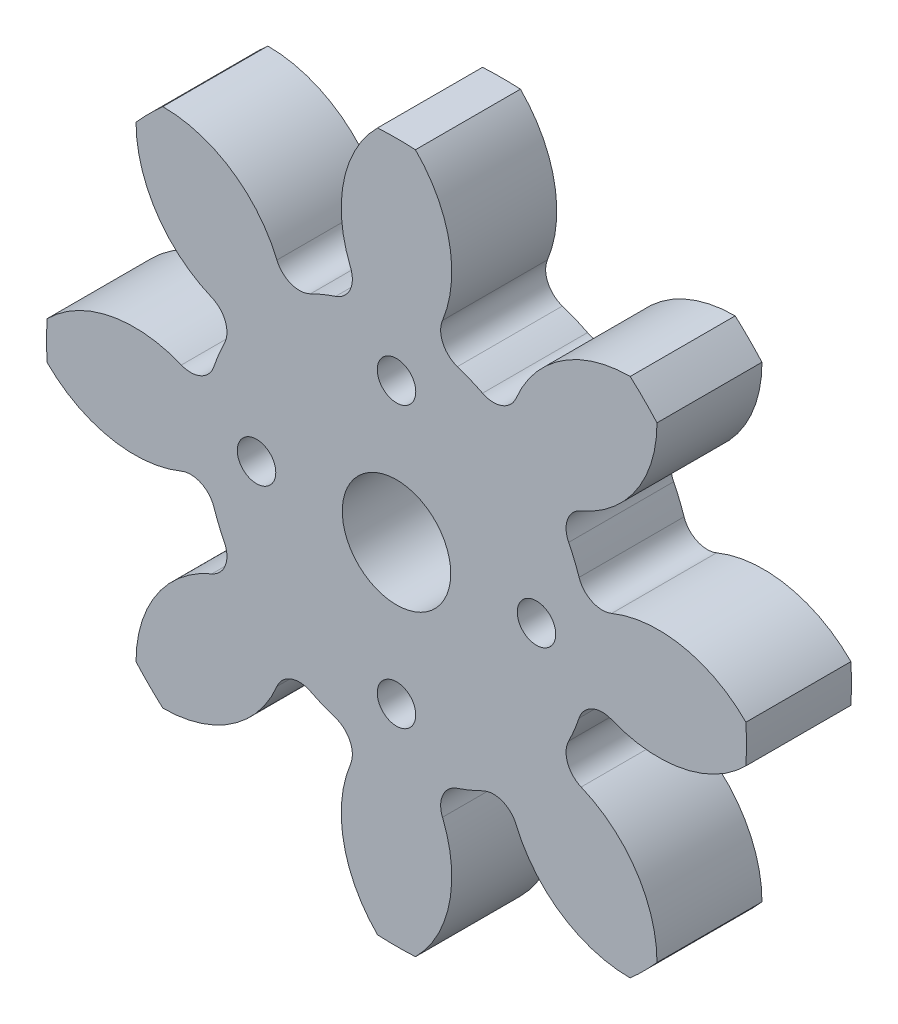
from build123d import *

# Parameters (mm, degrees)
BOSS_EXTRU_1_DEPTH                 = 6
CONG_1_R                           = 1.4
R_P_TITION_CIRCULAIRE4_COUNT       = 8
CONG_1_OF_R_P_TITION_CIRCULAIRE4_R = 1.4
ESQUISSE6_R                        = 3.1
ENL_V_MAT_EXTRU_1_DEPTH            = 29.913664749
ESQUISSE7_R                        = 1.1
ENL_V_MAT_EXTRU_2_DEPTH            = 2


with BuildPart() as part:
    # Esquisse3 → Boss.-Extru.1 (new body)
    with BuildSketch(Plane.XY):
        with BuildLine():
            Line((-4.209517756, 10.162674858), (0, 0))
            Line((0, 0), (4.209517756, 10.162674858))
            ThreePointArc((4.209517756, 10.162674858), (3.035498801, 10.572877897), (1.822680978, 10.847941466))
            ThreePointArc((1.822680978, 10.847941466), (3.134893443, 15.545936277), (1.081987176, 19.970711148))
            ThreePointArc((1.081987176, 19.970711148), (0, 20), (-1.081987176, 19.970711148))
            ThreePointArc((-1.081987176, 19.970711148), (-3.134893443, 15.545936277), (-1.822680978, 10.847941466))
            ThreePointArc((-1.822680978, 10.847941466), (-3.035498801, 10.572877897), (-4.209517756, 10.162674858))
        make_face()
    boss_extru_1 = extrude(amount=BOSS_EXTRU_1_DEPTH)

    # Cong_1
    cong_1_edges = [part.edges().sort_by_distance(p)[0] for p in [
        (-1.822680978, 10.847941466, 3),
        (1.822680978, 10.847941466, 3),
    ]]
    fillet(cong_1_edges, radius=CONG_1_R)

    # R_p_tition circulaire4: Boss.-Extru.1 ×8 about axis
    r_p_tition_circulaire4_axis = Axis((0, 0, 0), (0, 0, 1))
    for i in range(1, R_P_TITION_CIRCULAIRE4_COUNT):
        add(boss_extru_1.rotate(r_p_tition_circulaire4_axis, i * 360 / R_P_TITION_CIRCULAIRE4_COUNT))

    # Cong_1 of R_p_tition circulaire4
    cong_1_of_r_p_tition_circulaire4_edges = [part.edges().sort_by_distance(p)[0] for p in [
        (-8.959483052, 6.381822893, 3),
        (-6.381822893, 8.959483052, 3),
        (-10.847941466, -1.822680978, 3),
        (-10.847941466, 1.822680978, 3),
        (-6.381822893, -8.959483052, 3),
        (-8.959483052, -6.381822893, 3),
        (1.822680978, -10.847941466, 3),
        (-1.822680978, -10.847941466, 3),
        (8.959483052, -6.381822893, 3),
        (6.381822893, -8.959483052, 3),
        (10.847941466, 1.822680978, 3),
        (10.847941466, -1.822680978, 3),
        (6.381822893, 8.959483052, 3),
        (8.959483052, 6.381822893, 3),
    ]]
    fillet(cong_1_of_r_p_tition_circulaire4_edges, radius=CONG_1_OF_R_P_TITION_CIRCULAIRE4_R)

    # Esquisse6 → Enl_v. mat.-Extru.1 (cut, through all)
    with BuildSketch(Plane.XY.offset(6)):
        Circle(ESQUISSE6_R)
    extrude(amount=-ENL_V_MAT_EXTRU_1_DEPTH, mode=Mode.SUBTRACT)

    # Esquisse7 → Enl_v. mat.-Extru.2 (cut)
    with BuildSketch(Plane.XY.offset(6)):
        with Locations((0, 8)):
            Circle(ESQUISSE7_R)
        with Locations((-8, 0)):
            Circle(ESQUISSE7_R)
        with Locations((0, -8)):
            Circle(ESQUISSE7_R)
        with Locations((8, 0)):
            Circle(ESQUISSE7_R)
    extrude(amount=-ENL_V_MAT_EXTRU_2_DEPTH, mode=Mode.SUBTRACT)


solid = part.part
